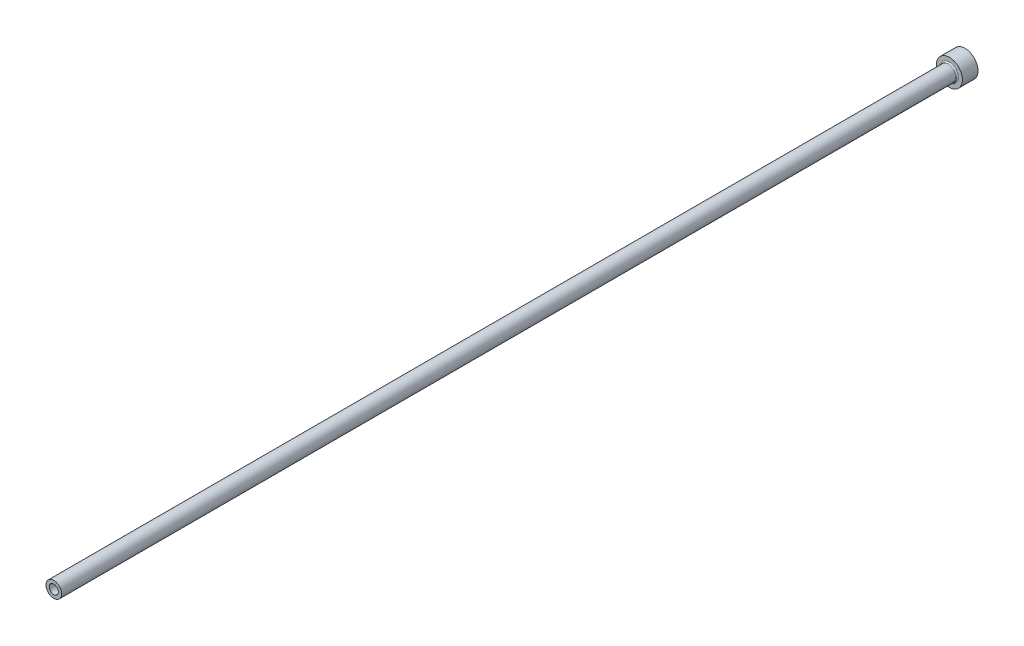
ISO-10303-21;
HEADER;
FILE_DESCRIPTION(('STEP AP214'),'2;1');
FILE_NAME('part.step','',(''),(''),'','','');
FILE_SCHEMA(('AUTOMOTIVE_DESIGN { 1 0 10303 214 1 1 1 1 }'));
ENDSEC;
DATA;
#1=APPLICATION_CONTEXT('core data for automotive mechanical design processes');
#2=APPLICATION_PROTOCOL_DEFINITION('international standard','automotive_design',2000,#1);
#3=PRODUCT_CONTEXT('',#1,'mechanical');
#4=PRODUCT('Part','Part','',(#3));
#5=PRODUCT_RELATED_PRODUCT_CATEGORY('part','',(#4));
#6=PRODUCT_DEFINITION_FORMATION('','',#4);
#7=PRODUCT_DEFINITION_CONTEXT('part definition',#1,'design');
#8=PRODUCT_DEFINITION('design','',#6,#7);
#9=PRODUCT_DEFINITION_SHAPE('','',#8);
#10=(LENGTH_UNIT() NAMED_UNIT(*) SI_UNIT(.MILLI.,.METRE.));
#11=(NAMED_UNIT(*) PLANE_ANGLE_UNIT() SI_UNIT($,.RADIAN.));
#12=(NAMED_UNIT(*) SI_UNIT($,.STERADIAN.) SOLID_ANGLE_UNIT());
#13=UNCERTAINTY_MEASURE_WITH_UNIT(LENGTH_MEASURE(1.E-05),#10,'distance_accuracy_value','');
#14=(GEOMETRIC_REPRESENTATION_CONTEXT(3) GLOBAL_UNCERTAINTY_ASSIGNED_CONTEXT((#13)) GLOBAL_UNIT_ASSIGNED_CONTEXT((#10,
#11,#12)) REPRESENTATION_CONTEXT('',''));
#15=CARTESIAN_POINT('',(0.,0.,0.));
#16=DIRECTION('',(0.,0.,1.));
#17=DIRECTION('',(1.,0.,0.));
#18=AXIS2_PLACEMENT_3D('',#15,#16,#17);
#19=CARTESIAN_POINT('',(0.,0.,350.));
#20=DIRECTION('',(0.,0.,-1.));
#21=DIRECTION('',(-1.,0.,0.));
#22=AXIS2_PLACEMENT_3D('',#19,#20,#21);
#23=PLANE('',#22);
#24=CARTESIAN_POINT('',(0.,0.,350.));
#25=DIRECTION('',(0.,0.,1.));
#26=DIRECTION('',(1.,0.,0.));
#27=AXIS2_PLACEMENT_3D('',#24,#25,#26);
#28=CIRCLE('',#27,1.74999999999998);
#29=CARTESIAN_POINT('',(1.74999999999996,0.,350.));
#30=VERTEX_POINT('',#29);
#31=EDGE_CURVE('E63',#30,#30,#28,.T.);
#32=ORIENTED_EDGE('',*,*,#31,.F.);
#33=EDGE_LOOP('',(#32));
#34=FACE_BOUND('',#33,.T.);
#35=CARTESIAN_POINT('',(0.,0.,350.));
#36=DIRECTION('',(0.,0.,1.));
#37=DIRECTION('',(1.,0.,0.));
#38=AXIS2_PLACEMENT_3D('',#35,#36,#37);
#39=CIRCLE('',#38,2.99999999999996);
#40=CARTESIAN_POINT('',(2.99999999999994,0.,350.));
#41=VERTEX_POINT('',#40);
#42=EDGE_CURVE('E54',#41,#41,#39,.T.);
#43=ORIENTED_EDGE('',*,*,#42,.T.);
#44=EDGE_LOOP('',(#43));
#45=FACE_BOUND('',#44,.T.);
#46=ADVANCED_FACE('F34',(#34,#45),#23,.F.);
#47=CARTESIAN_POINT('',(0.,0.,350.));
#48=DIRECTION('',(0.,0.,1.));
#49=DIRECTION('',(1.,0.,0.));
#50=AXIS2_PLACEMENT_3D('',#47,#48,#49);
#51=CYLINDRICAL_SURFACE('',#50,2.99999999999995);
#52=CARTESIAN_POINT('',(0.,0.,6.50000000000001));
#53=DIRECTION('',(0.,0.,1.));
#54=DIRECTION('',(1.,0.,0.));
#55=AXIS2_PLACEMENT_3D('',#52,#53,#54);
#56=CIRCLE('',#55,2.99999999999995);
#57=CARTESIAN_POINT('',(2.99999999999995,0.,6.50000000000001));
#58=VERTEX_POINT('',#57);
#59=EDGE_CURVE('E49',#58,#58,#56,.T.);
#60=ORIENTED_EDGE('',*,*,#59,.T.);
#61=EDGE_LOOP('',(#60));
#62=FACE_BOUND('',#61,.T.);
#63=ORIENTED_EDGE('',*,*,#42,.F.);
#64=EDGE_LOOP('',(#63));
#65=FACE_BOUND('',#64,.T.);
#66=ADVANCED_FACE('F92',(#62,#65),#51,.T.);
#67=CARTESIAN_POINT('',(0.,0.,6.));
#68=DIRECTION('',(0.,0.,1.));
#69=DIRECTION('',(1.,0.,0.));
#70=AXIS2_PLACEMENT_3D('',#67,#68,#69);
#71=PLANE('',#70);
#72=CARTESIAN_POINT('',(0.,0.,6.));
#73=DIRECTION('',(0.,0.,1.));
#74=DIRECTION('',(1.,0.,0.));
#75=AXIS2_PLACEMENT_3D('',#72,#73,#74);
#76=CIRCLE('',#75,3.49999999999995);
#77=CARTESIAN_POINT('',(3.49999999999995,0.,6.));
#78=VERTEX_POINT('',#77);
#79=EDGE_CURVE('E45',#78,#78,#76,.F.);
#80=ORIENTED_EDGE('',*,*,#79,.T.);
#81=EDGE_LOOP('',(#80));
#82=FACE_BOUND('',#81,.T.);
#83=CARTESIAN_POINT('',(0.,0.,6.00000000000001));
#84=DIRECTION('',(0.,0.,1.));
#85=DIRECTION('',(1.,0.,0.));
#86=AXIS2_PLACEMENT_3D('',#83,#84,#85);
#87=CIRCLE('',#86,4.99999999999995);
#88=CARTESIAN_POINT('',(4.99999999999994,0.,6.00000000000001));
#89=VERTEX_POINT('',#88);
#90=EDGE_CURVE('E57',#89,#89,#87,.T.);
#91=ORIENTED_EDGE('',*,*,#90,.T.);
#92=EDGE_LOOP('',(#91));
#93=FACE_BOUND('',#92,.T.);
#94=ADVANCED_FACE('F98',(#82,#93),#71,.T.);
#95=CARTESIAN_POINT('',(0.,0.,350.));
#96=DIRECTION('',(0.,0.,1.));
#97=DIRECTION('',(1.,0.,0.));
#98=AXIS2_PLACEMENT_3D('',#95,#96,#97);
#99=CYLINDRICAL_SURFACE('',#98,4.99999999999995);
#100=ORIENTED_EDGE('',*,*,#90,.F.);
#101=EDGE_LOOP('',(#100));
#102=FACE_BOUND('',#101,.T.);
#103=CARTESIAN_POINT('',(0.,0.,0.));
#104=DIRECTION('',(0.,0.,1.));
#105=DIRECTION('',(1.,0.,0.));
#106=AXIS2_PLACEMENT_3D('',#103,#104,#105);
#107=CIRCLE('',#106,4.99999999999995);
#108=CARTESIAN_POINT('',(4.99999999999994,0.,0.));
#109=VERTEX_POINT('',#108);
#110=EDGE_CURVE('E60',#109,#109,#107,.T.);
#111=ORIENTED_EDGE('',*,*,#110,.T.);
#112=EDGE_LOOP('',(#111));
#113=FACE_BOUND('',#112,.T.);
#114=ADVANCED_FACE('F89',(#102,#113),#99,.T.);
#115=CARTESIAN_POINT('',(0.,0.,0.));
#116=DIRECTION('',(0.,0.,1.));
#117=DIRECTION('',(1.,0.,0.));
#118=AXIS2_PLACEMENT_3D('',#115,#116,#117);
#119=PLANE('',#118);
#120=CARTESIAN_POINT('',(0.,0.,0.));
#121=DIRECTION('',(0.,0.,1.));
#122=DIRECTION('',(1.,0.,0.));
#123=AXIS2_PLACEMENT_3D('',#120,#121,#122);
#124=CIRCLE('',#123,2.5);
#125=CARTESIAN_POINT('',(2.49999999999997,0.,0.));
#126=VERTEX_POINT('',#125);
#127=EDGE_CURVE('E41',#126,#126,#124,.T.);
#128=ORIENTED_EDGE('',*,*,#127,.T.);
#129=EDGE_LOOP('',(#128));
#130=FACE_BOUND('',#129,.T.);
#131=ORIENTED_EDGE('',*,*,#110,.F.);
#132=EDGE_LOOP('',(#131));
#133=FACE_BOUND('',#132,.T.);
#134=ADVANCED_FACE('F83',(#130,#133),#119,.F.);
#135=CARTESIAN_POINT('',(0.,0.,350.));
#136=DIRECTION('',(0.,0.,1.));
#137=DIRECTION('',(1.,0.,0.));
#138=AXIS2_PLACEMENT_3D('',#135,#136,#137);
#139=CYLINDRICAL_SURFACE('',#138,1.75);
#140=ORIENTED_EDGE('',*,*,#31,.T.);
#141=EDGE_LOOP('',(#140));
#142=FACE_BOUND('',#141,.T.);
#143=CARTESIAN_POINT('',(0.,0.,235.));
#144=DIRECTION('',(0.,0.,1.));
#145=DIRECTION('',(1.,0.,0.));
#146=AXIS2_PLACEMENT_3D('',#143,#144,#145);
#147=CIRCLE('',#146,1.75000000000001);
#148=CARTESIAN_POINT('',(1.74999999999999,0.,235.));
#149=VERTEX_POINT('',#148);
#150=EDGE_CURVE('E66',#149,#149,#147,.T.);
#151=ORIENTED_EDGE('',*,*,#150,.F.);
#152=EDGE_LOOP('',(#151));
#153=FACE_BOUND('',#152,.T.);
#154=ADVANCED_FACE('F78',(#142,#153),#139,.F.);
#155=CARTESIAN_POINT('',(0.,0.,235.));
#156=DIRECTION('',(0.,0.,-1.));
#157=DIRECTION('',(-1.,0.,0.));
#158=AXIS2_PLACEMENT_3D('',#155,#156,#157);
#159=CONICAL_SURFACE('',#158,1.75000000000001,0.523598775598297);
#160=CARTESIAN_POINT('',(0.,0.,234.566987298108));
#161=DIRECTION('',(0.,0.,1.));
#162=DIRECTION('',(1.,0.,0.));
#163=AXIS2_PLACEMENT_3D('',#160,#161,#162);
#164=CIRCLE('',#163,2.00000000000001);
#165=CARTESIAN_POINT('',(1.99999999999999,0.,234.566987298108));
#166=VERTEX_POINT('',#165);
#167=EDGE_CURVE('E69',#166,#166,#164,.T.);
#168=ORIENTED_EDGE('',*,*,#167,.F.);
#169=EDGE_LOOP('',(#168));
#170=FACE_BOUND('',#169,.T.);
#171=ORIENTED_EDGE('',*,*,#150,.T.);
#172=EDGE_LOOP('',(#171));
#173=FACE_BOUND('',#172,.T.);
#174=ADVANCED_FACE('F75',(#170,#173),#159,.F.);
#175=CARTESIAN_POINT('',(0.,0.,350.));
#176=DIRECTION('',(0.,0.,1.));
#177=DIRECTION('',(1.,0.,0.));
#178=AXIS2_PLACEMENT_3D('',#175,#176,#177);
#179=CYLINDRICAL_SURFACE('',#178,1.99999999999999);
#180=CARTESIAN_POINT('',(0.,0.,0.5));
#181=DIRECTION('',(0.,0.,1.));
#182=DIRECTION('',(1.,0.,0.));
#183=AXIS2_PLACEMENT_3D('',#180,#181,#182);
#184=CIRCLE('',#183,1.99999999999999);
#185=CARTESIAN_POINT('',(1.99999999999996,0.,0.5));
#186=VERTEX_POINT('',#185);
#187=EDGE_CURVE('E10',#186,#186,#184,.F.);
#188=ORIENTED_EDGE('',*,*,#187,.T.);
#189=EDGE_LOOP('',(#188));
#190=FACE_BOUND('',#189,.T.);
#191=ORIENTED_EDGE('',*,*,#167,.T.);
#192=EDGE_LOOP('',(#191));
#193=FACE_BOUND('',#192,.T.);
#194=ADVANCED_FACE('F73',(#190,#193),#179,.F.);
#195=CARTESIAN_POINT('',(0.,0.,6.50000000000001));
#196=DIRECTION('',(0.,0.,1.));
#197=DIRECTION('',(1.,0.,0.));
#198=AXIS2_PLACEMENT_3D('',#195,#196,#197);
#199=TOROIDAL_SURFACE('',#198,3.49999999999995,0.5);
#200=ORIENTED_EDGE('',*,*,#79,.F.);
#201=EDGE_LOOP('',(#200));
#202=FACE_BOUND('',#201,.T.);
#203=ORIENTED_EDGE('',*,*,#59,.F.);
#204=EDGE_LOOP('',(#203));
#205=FACE_BOUND('',#204,.T.);
#206=ADVANCED_FACE('F104',(#202,#205),#199,.F.);
#207=CARTESIAN_POINT('',(0.,0.,0.));
#208=DIRECTION('',(0.,0.,-1.));
#209=DIRECTION('',(-1.,0.,0.));
#210=AXIS2_PLACEMENT_3D('',#207,#208,#209);
#211=CONICAL_SURFACE('',#210,2.5,0.785398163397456);
#212=ORIENTED_EDGE('',*,*,#187,.F.);
#213=EDGE_LOOP('',(#212));
#214=FACE_BOUND('',#213,.T.);
#215=ORIENTED_EDGE('',*,*,#127,.F.);
#216=EDGE_LOOP('',(#215));
#217=FACE_BOUND('',#216,.T.);
#218=ADVANCED_FACE('F36',(#214,#217),#211,.F.);
#219=CLOSED_SHELL('',(#46,#66,#94,#114,#134,#154,#174,#194,#206,#218));
#220=MANIFOLD_SOLID_BREP('B2',#219);
#221=ADVANCED_BREP_SHAPE_REPRESENTATION('',(#18,#220),#14);
#222=SHAPE_DEFINITION_REPRESENTATION(#9,#221);
ENDSEC;
END-ISO-10303-21;
